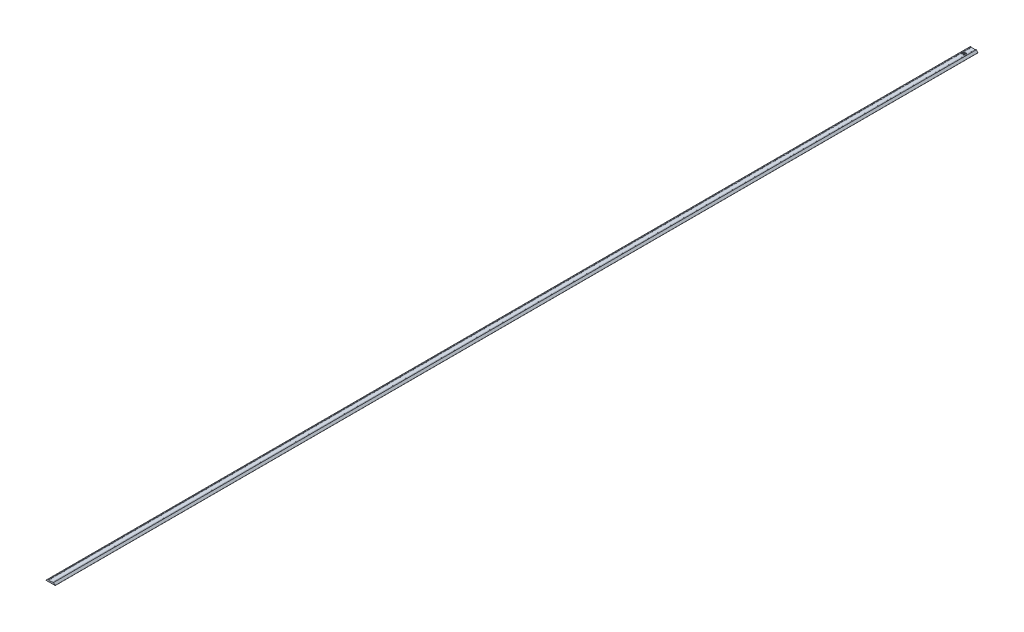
from build123d import *

# Parameters (mm, degrees)
EXTRUDE1_DEPTH                                      = 2000
CBORE_FOR_M3_HEX_SOCKET_HEAD_CAP_SCREW1_D           = 3.4
CBORE_FOR_M3_HEX_SOCKET_HEAD_CAP_SCREW1_CBORE_D     = 7.5
CBORE_FOR_M3_HEX_SOCKET_HEAD_CAP_SCREW1_CBORE_DEPTH = 1.5


with BuildPart() as part:
    # Sketch1 → Extrude1 (new body)
    with BuildSketch(Plane.XY):
        with BuildLine():
            Line((0.1, 0), (3, 0))
            Line((3, 0), (3, 0.05))
            Line((3, 0.05), (17, 0.05))
            Line((17, 0.05), (17, 0))
            Line((17, 0), (19.9, 0))
            ThreePointArc((19.9, 0), (19.970710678, 0.029289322), (20, 0.1))
            Line((20, 0.1), (20, 0.258578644))
            ThreePointArc((20, 0.258578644), (19.992387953, 0.296846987), (19.970710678, 0.329289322))
            Line((19.970710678, 0.329289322), (16.329289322, 3.970710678))
            ThreePointArc((16.329289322, 3.970710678), (16.296846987, 3.992387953), (16.258578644, 4))
            Line((16.258578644, 4), (14.65, 4))
            ThreePointArc((14.65, 4), (14.543933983, 3.956066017), (14.5, 3.85))
            Line((14.5, 3.85), (14.5, 3.75))
            ThreePointArc((14.5, 3.75), (14.543933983, 3.643933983), (14.65, 3.6))
            Line((14.65, 3.6), (14.975, 3.6))
            ThreePointArc((14.975, 3.6), (15.081066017, 3.556066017), (15.125, 3.45))
            Line((15.125, 3.45), (15.125, 3.4))
            ThreePointArc((15.125, 3.4), (15.081066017, 3.293933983), (14.975, 3.25))
            Line((14.975, 3.25), (14, 3.25))
            Line((14, 3.25), (14, 3.2))
            Line((14, 3.2), (9.9, 3.2))
            Line((9.9, 3.2), (6, 3.2))
            Line((6, 3.2), (6, 3.25))
            Line((6, 3.25), (5.025, 3.25))
            ThreePointArc((5.025, 3.25), (4.918933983, 3.293933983), (4.875, 3.4))
            Line((4.875, 3.4), (4.875, 3.45))
            ThreePointArc((4.875, 3.45), (4.918933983, 3.556066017), (5.025, 3.6))
            Line((5.025, 3.6), (5.35, 3.6))
            ThreePointArc((5.35, 3.6), (5.456066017, 3.643933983), (5.5, 3.75))
            Line((5.5, 3.75), (5.5, 3.85))
            ThreePointArc((5.5, 3.85), (5.456066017, 3.956066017), (5.35, 4))
            Line((5.35, 4), (3.741421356, 4))
            ThreePointArc((3.741421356, 4), (3.703153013, 3.992387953), (3.670710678, 3.970710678))
            Line((3.670710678, 3.970710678), (0.029289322, 0.329289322))
            ThreePointArc((0.029289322, 0.329289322), (0.007612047, 0.296846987), (0, 0.258578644))
            Line((0, 0.258578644), (0, 0.1))
            ThreePointArc((0, 0.1), (0.029289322, 0.029289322), (0.1, 0))
        make_face()
    extrude(amount=EXTRUDE1_DEPTH)

    # CBORE for M3 Hex Socket Head Cap Screw1 (through all)
    with Locations(Plane(origin=(0, 3.2, 0), x_dir=(-1, 0, 0), z_dir=(0, 1, 0))):
        with Locations((-10, 20)):
            CounterBoreHole(CBORE_FOR_M3_HEX_SOCKET_HEAD_CAP_SCREW1_D / 2, CBORE_FOR_M3_HEX_SOCKET_HEAD_CAP_SCREW1_CBORE_D / 2, CBORE_FOR_M3_HEX_SOCKET_HEAD_CAP_SCREW1_CBORE_DEPTH)


solid = part.part
